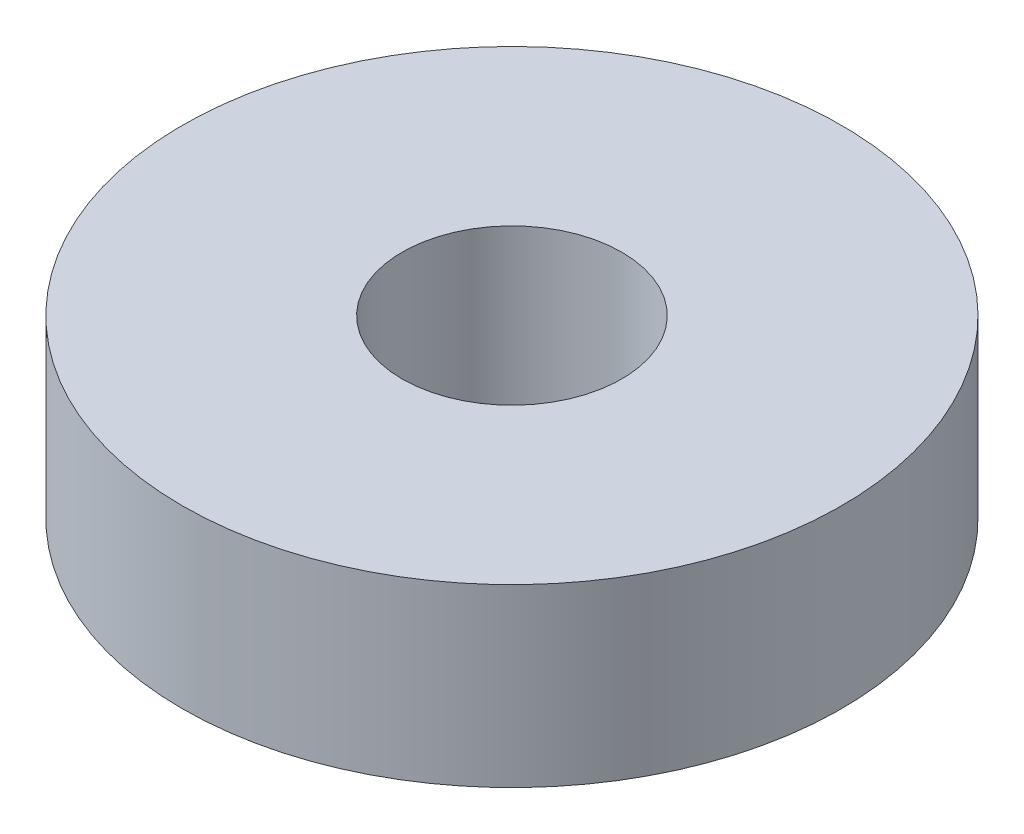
ISO-10303-21;
HEADER;
FILE_DESCRIPTION(('STEP AP214'),'2;1');
FILE_NAME('part.step','',(''),(''),'','','');
FILE_SCHEMA(('AUTOMOTIVE_DESIGN { 1 0 10303 214 1 1 1 1 }'));
ENDSEC;
DATA;
#1=APPLICATION_CONTEXT('core data for automotive mechanical design processes');
#2=APPLICATION_PROTOCOL_DEFINITION('international standard','automotive_design',2000,#1);
#3=PRODUCT_CONTEXT('',#1,'mechanical');
#4=PRODUCT('Part','Part','',(#3));
#5=PRODUCT_RELATED_PRODUCT_CATEGORY('part','',(#4));
#6=PRODUCT_DEFINITION_FORMATION('','',#4);
#7=PRODUCT_DEFINITION_CONTEXT('part definition',#1,'design');
#8=PRODUCT_DEFINITION('design','',#6,#7);
#9=PRODUCT_DEFINITION_SHAPE('','',#8);
#10=(LENGTH_UNIT() NAMED_UNIT(*) SI_UNIT(.MILLI.,.METRE.));
#11=(NAMED_UNIT(*) PLANE_ANGLE_UNIT() SI_UNIT($,.RADIAN.));
#12=(NAMED_UNIT(*) SI_UNIT($,.STERADIAN.) SOLID_ANGLE_UNIT());
#13=UNCERTAINTY_MEASURE_WITH_UNIT(LENGTH_MEASURE(1.E-05),#10,'distance_accuracy_value','');
#14=(GEOMETRIC_REPRESENTATION_CONTEXT(3) GLOBAL_UNCERTAINTY_ASSIGNED_CONTEXT((#13)) GLOBAL_UNIT_ASSIGNED_CONTEXT((#10,
#11,#12)) REPRESENTATION_CONTEXT('',''));
#15=CARTESIAN_POINT('',(0.,0.,0.));
#16=DIRECTION('',(0.,0.,1.));
#17=DIRECTION('',(1.,0.,0.));
#18=AXIS2_PLACEMENT_3D('',#15,#16,#17);
#19=CARTESIAN_POINT('',(0.,4.,0.));
#20=DIRECTION('',(0.,1.,0.));
#21=DIRECTION('',(0.,0.,1.));
#22=AXIS2_PLACEMENT_3D('',#19,#20,#21);
#23=PLANE('',#22);
#24=CARTESIAN_POINT('',(0.,4.,0.));
#25=DIRECTION('',(0.,1.,0.));
#26=DIRECTION('',(0.,0.,1.));
#27=AXIS2_PLACEMENT_3D('',#24,#25,#26);
#28=CIRCLE('',#27,7.5);
#29=CARTESIAN_POINT('',(0.,4.,7.5));
#30=VERTEX_POINT('',#29);
#31=EDGE_CURVE('E10',#30,#30,#28,.T.);
#32=ORIENTED_EDGE('',*,*,#31,.T.);
#33=EDGE_LOOP('',(#32));
#34=FACE_BOUND('',#33,.T.);
#35=CARTESIAN_POINT('',(0.,4.,0.));
#36=DIRECTION('',(0.,1.,0.));
#37=DIRECTION('',(0.,0.,1.));
#38=AXIS2_PLACEMENT_3D('',#35,#36,#37);
#39=CIRCLE('',#38,2.5);
#40=CARTESIAN_POINT('',(0.,4.,2.5));
#41=VERTEX_POINT('',#40);
#42=EDGE_CURVE('E44',#41,#41,#39,.T.);
#43=ORIENTED_EDGE('',*,*,#42,.F.);
#44=EDGE_LOOP('',(#43));
#45=FACE_BOUND('',#44,.T.);
#46=ADVANCED_FACE('F33',(#34,#45),#23,.T.);
#47=CARTESIAN_POINT('',(0.,0.,0.));
#48=DIRECTION('',(0.,1.,0.));
#49=DIRECTION('',(0.,0.,1.));
#50=AXIS2_PLACEMENT_3D('',#47,#48,#49);
#51=PLANE('',#50);
#52=CARTESIAN_POINT('',(0.,0.,0.));
#53=DIRECTION('',(0.,1.,0.));
#54=DIRECTION('',(0.,0.,1.));
#55=AXIS2_PLACEMENT_3D('',#52,#53,#54);
#56=CIRCLE('',#55,7.5);
#57=CARTESIAN_POINT('',(0.,0.,7.5));
#58=VERTEX_POINT('',#57);
#59=EDGE_CURVE('E37',#58,#58,#56,.T.);
#60=ORIENTED_EDGE('',*,*,#59,.F.);
#61=EDGE_LOOP('',(#60));
#62=FACE_BOUND('',#61,.T.);
#63=CARTESIAN_POINT('',(0.,0.,0.));
#64=DIRECTION('',(0.,1.,0.));
#65=DIRECTION('',(0.,0.,1.));
#66=AXIS2_PLACEMENT_3D('',#63,#64,#65);
#67=CIRCLE('',#66,2.5);
#68=CARTESIAN_POINT('',(0.,0.,2.5));
#69=VERTEX_POINT('',#68);
#70=EDGE_CURVE('E46',#69,#69,#67,.T.);
#71=ORIENTED_EDGE('',*,*,#70,.T.);
#72=EDGE_LOOP('',(#71));
#73=FACE_BOUND('',#72,.T.);
#74=ADVANCED_FACE('F56',(#62,#73),#51,.F.);
#75=CARTESIAN_POINT('',(0.,4.,0.));
#76=DIRECTION('',(0.,-1.,0.));
#77=DIRECTION('',(0.,0.,-1.));
#78=AXIS2_PLACEMENT_3D('',#75,#76,#77);
#79=CYLINDRICAL_SURFACE('',#78,7.5);
#80=ORIENTED_EDGE('',*,*,#31,.F.);
#81=EDGE_LOOP('',(#80));
#82=FACE_BOUND('',#81,.T.);
#83=ORIENTED_EDGE('',*,*,#59,.T.);
#84=EDGE_LOOP('',(#83));
#85=FACE_BOUND('',#84,.T.);
#86=ADVANCED_FACE('F35',(#82,#85),#79,.T.);
#87=CARTESIAN_POINT('',(0.,4.,0.));
#88=DIRECTION('',(0.,-1.,0.));
#89=DIRECTION('',(0.,0.,-1.));
#90=AXIS2_PLACEMENT_3D('',#87,#88,#89);
#91=CYLINDRICAL_SURFACE('',#90,2.5);
#92=ORIENTED_EDGE('',*,*,#42,.T.);
#93=EDGE_LOOP('',(#92));
#94=FACE_BOUND('',#93,.T.);
#95=ORIENTED_EDGE('',*,*,#70,.F.);
#96=EDGE_LOOP('',(#95));
#97=FACE_BOUND('',#96,.T.);
#98=ADVANCED_FACE('F52',(#94,#97),#91,.F.);
#99=CLOSED_SHELL('',(#46,#74,#86,#98));
#100=MANIFOLD_SOLID_BREP('B2',#99);
#101=ADVANCED_BREP_SHAPE_REPRESENTATION('',(#18,#100),#14);
#102=SHAPE_DEFINITION_REPRESENTATION(#9,#101);
ENDSEC;
END-ISO-10303-21;
